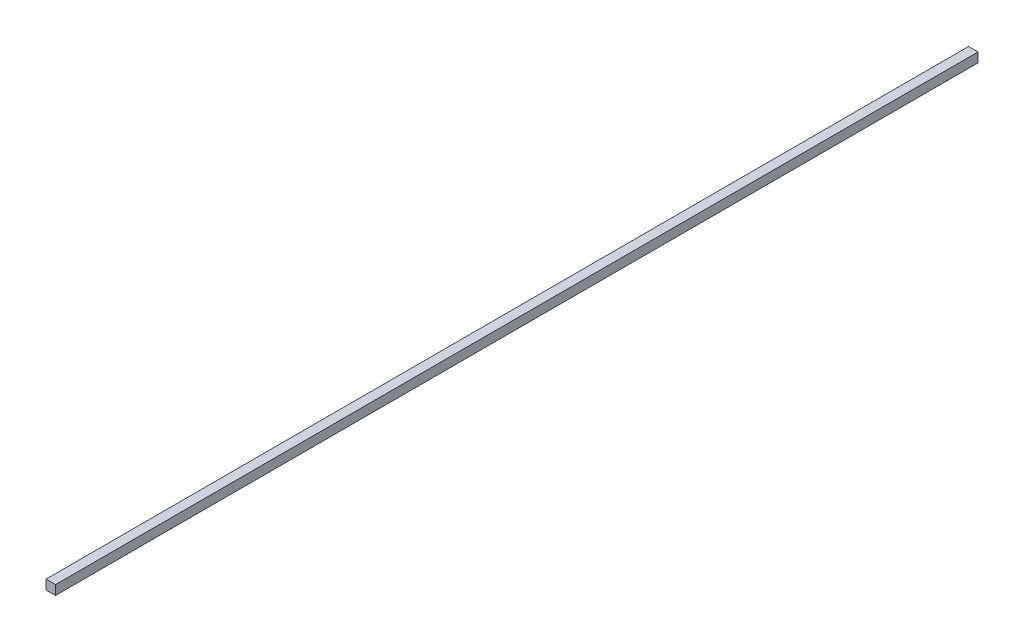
ISO-10303-21;
HEADER;
FILE_DESCRIPTION(('STEP AP214'),'2;1');
FILE_NAME('part.step','',(''),(''),'','','');
FILE_SCHEMA(('AUTOMOTIVE_DESIGN { 1 0 10303 214 1 1 1 1 }'));
ENDSEC;
DATA;
#1=APPLICATION_CONTEXT('core data for automotive mechanical design processes');
#2=APPLICATION_PROTOCOL_DEFINITION('international standard','automotive_design',2000,#1);
#3=PRODUCT_CONTEXT('',#1,'mechanical');
#4=PRODUCT('Part','Part','',(#3));
#5=PRODUCT_RELATED_PRODUCT_CATEGORY('part','',(#4));
#6=PRODUCT_DEFINITION_FORMATION('','',#4);
#7=PRODUCT_DEFINITION_CONTEXT('part definition',#1,'design');
#8=PRODUCT_DEFINITION('design','',#6,#7);
#9=PRODUCT_DEFINITION_SHAPE('','',#8);
#10=(LENGTH_UNIT() NAMED_UNIT(*) SI_UNIT(.MILLI.,.METRE.));
#11=(NAMED_UNIT(*) PLANE_ANGLE_UNIT() SI_UNIT($,.RADIAN.));
#12=(NAMED_UNIT(*) SI_UNIT($,.STERADIAN.) SOLID_ANGLE_UNIT());
#13=UNCERTAINTY_MEASURE_WITH_UNIT(LENGTH_MEASURE(1.E-05),#10,'distance_accuracy_value','');
#14=(GEOMETRIC_REPRESENTATION_CONTEXT(3) GLOBAL_UNCERTAINTY_ASSIGNED_CONTEXT((#13)) GLOBAL_UNIT_ASSIGNED_CONTEXT((#10,
#11,#12)) REPRESENTATION_CONTEXT('',''));
#15=CARTESIAN_POINT('',(0.,0.,0.));
#16=DIRECTION('',(0.,0.,1.));
#17=DIRECTION('',(1.,0.,0.));
#18=AXIS2_PLACEMENT_3D('',#15,#16,#17);
#19=CARTESIAN_POINT('',(-1.,1.,97.5));
#20=DIRECTION('',(1.,0.,0.));
#21=DIRECTION('',(0.,0.,-1.));
#22=AXIS2_PLACEMENT_3D('',#19,#20,#21);
#23=PLANE('',#22);
#24=DIRECTION('',(0.,-1.,0.));
#25=VECTOR('',#24,1.);
#26=CARTESIAN_POINT('',(-1.,1.,-97.5));
#27=LINE('',#26,#25);
#28=CARTESIAN_POINT('',(-1.,1.,-97.5));
#29=VERTEX_POINT('',#28);
#30=CARTESIAN_POINT('',(-1.,-1.,-97.5));
#31=VERTEX_POINT('',#30);
#32=EDGE_CURVE('E70',#29,#31,#27,.T.);
#33=ORIENTED_EDGE('',*,*,#32,.T.);
#34=DIRECTION('',(0.,0.,-1.));
#35=VECTOR('',#34,1.);
#36=CARTESIAN_POINT('',(-1.,-1.,97.5));
#37=LINE('',#36,#35);
#38=CARTESIAN_POINT('',(-1.,-1.,97.5));
#39=VERTEX_POINT('',#38);
#40=EDGE_CURVE('E11',#39,#31,#37,.T.);
#41=ORIENTED_EDGE('',*,*,#40,.F.);
#42=DIRECTION('',(0.,-1.,0.));
#43=VECTOR('',#42,1.);
#44=CARTESIAN_POINT('',(-1.,1.,97.5));
#45=LINE('',#44,#43);
#46=CARTESIAN_POINT('',(-1.,1.,97.5));
#47=VERTEX_POINT('',#46);
#48=EDGE_CURVE('E88',#47,#39,#45,.T.);
#49=ORIENTED_EDGE('',*,*,#48,.F.);
#50=DIRECTION('',(0.,0.,-1.));
#51=VECTOR('',#50,1.);
#52=CARTESIAN_POINT('',(-1.,1.,97.5));
#53=LINE('',#52,#51);
#54=EDGE_CURVE('E82',#47,#29,#53,.T.);
#55=ORIENTED_EDGE('',*,*,#54,.T.);
#56=EDGE_LOOP('',(#33,#41,#49,#55));
#57=FACE_BOUND('',#56,.T.);
#58=ADVANCED_FACE('F26',(#57),#23,.F.);
#59=CARTESIAN_POINT('',(-1.,-1.,97.5));
#60=DIRECTION('',(0.,1.,0.));
#61=DIRECTION('',(0.,0.,1.));
#62=AXIS2_PLACEMENT_3D('',#59,#60,#61);
#63=PLANE('',#62);
#64=DIRECTION('',(1.,0.,0.));
#65=VECTOR('',#64,1.);
#66=CARTESIAN_POINT('',(-1.,-1.,-97.5));
#67=LINE('',#66,#65);
#68=CARTESIAN_POINT('',(1.,-1.,-97.5));
#69=VERTEX_POINT('',#68);
#70=EDGE_CURVE('E66',#31,#69,#67,.T.);
#71=ORIENTED_EDGE('',*,*,#70,.T.);
#72=DIRECTION('',(0.,0.,-1.));
#73=VECTOR('',#72,1.);
#74=CARTESIAN_POINT('',(1.,-1.,97.5));
#75=LINE('',#74,#73);
#76=CARTESIAN_POINT('',(1.,-1.,97.5));
#77=VERTEX_POINT('',#76);
#78=EDGE_CURVE('E33',#77,#69,#75,.T.);
#79=ORIENTED_EDGE('',*,*,#78,.F.);
#80=DIRECTION('',(1.,0.,0.));
#81=VECTOR('',#80,1.);
#82=CARTESIAN_POINT('',(-1.,-1.,97.5));
#83=LINE('',#82,#81);
#84=EDGE_CURVE('E78',#39,#77,#83,.T.);
#85=ORIENTED_EDGE('',*,*,#84,.F.);
#86=ORIENTED_EDGE('',*,*,#40,.T.);
#87=EDGE_LOOP('',(#71,#79,#85,#86));
#88=FACE_BOUND('',#87,.T.);
#89=ADVANCED_FACE('F77',(#88),#63,.F.);
#90=CARTESIAN_POINT('',(1.,1.,97.5));
#91=DIRECTION('',(-1.,0.,0.));
#92=DIRECTION('',(0.,-1.,0.));
#93=AXIS2_PLACEMENT_3D('',#90,#91,#92);
#94=PLANE('',#93);
#95=DIRECTION('',(0.,1.,0.));
#96=VECTOR('',#95,1.);
#97=CARTESIAN_POINT('',(1.,1.,-97.5));
#98=LINE('',#97,#96);
#99=CARTESIAN_POINT('',(1.,1.,-97.5));
#100=VERTEX_POINT('',#99);
#101=EDGE_CURVE('E71',#69,#100,#98,.T.);
#102=ORIENTED_EDGE('',*,*,#101,.T.);
#103=DIRECTION('',(0.,0.,-1.));
#104=VECTOR('',#103,1.);
#105=CARTESIAN_POINT('',(1.,1.,97.5));
#106=LINE('',#105,#104);
#107=CARTESIAN_POINT('',(1.,1.,97.5));
#108=VERTEX_POINT('',#107);
#109=EDGE_CURVE('E94',#108,#100,#106,.T.);
#110=ORIENTED_EDGE('',*,*,#109,.F.);
#111=DIRECTION('',(0.,1.,0.));
#112=VECTOR('',#111,1.);
#113=CARTESIAN_POINT('',(1.,1.,97.5));
#114=LINE('',#113,#112);
#115=EDGE_CURVE('E45',#77,#108,#114,.T.);
#116=ORIENTED_EDGE('',*,*,#115,.F.);
#117=ORIENTED_EDGE('',*,*,#78,.T.);
#118=EDGE_LOOP('',(#102,#110,#116,#117));
#119=FACE_BOUND('',#118,.T.);
#120=ADVANCED_FACE('F97',(#119),#94,.F.);
#121=CARTESIAN_POINT('',(-1.,1.,97.5));
#122=DIRECTION('',(0.,-1.,0.));
#123=DIRECTION('',(1.,0.,0.));
#124=AXIS2_PLACEMENT_3D('',#121,#122,#123);
#125=PLANE('',#124);
#126=DIRECTION('',(-1.,0.,0.));
#127=VECTOR('',#126,1.);
#128=CARTESIAN_POINT('',(-1.,1.,-97.5));
#129=LINE('',#128,#127);
#130=EDGE_CURVE('E86',#100,#29,#129,.T.);
#131=ORIENTED_EDGE('',*,*,#130,.T.);
#132=ORIENTED_EDGE('',*,*,#54,.F.);
#133=DIRECTION('',(-1.,0.,0.));
#134=VECTOR('',#133,1.);
#135=CARTESIAN_POINT('',(-1.,1.,97.5));
#136=LINE('',#135,#134);
#137=EDGE_CURVE('E40',#108,#47,#136,.T.);
#138=ORIENTED_EDGE('',*,*,#137,.F.);
#139=ORIENTED_EDGE('',*,*,#109,.T.);
#140=EDGE_LOOP('',(#131,#132,#138,#139));
#141=FACE_BOUND('',#140,.T.);
#142=ADVANCED_FACE('F99',(#141),#125,.F.);
#143=CARTESIAN_POINT('',(-1.,-1.,97.5));
#144=DIRECTION('',(0.,0.,1.));
#145=DIRECTION('',(1.,0.,0.));
#146=AXIS2_PLACEMENT_3D('',#143,#144,#145);
#147=PLANE('',#146);
#148=ORIENTED_EDGE('',*,*,#48,.T.);
#149=ORIENTED_EDGE('',*,*,#84,.T.);
#150=ORIENTED_EDGE('',*,*,#115,.T.);
#151=ORIENTED_EDGE('',*,*,#137,.T.);
#152=EDGE_LOOP('',(#148,#149,#150,#151));
#153=FACE_BOUND('',#152,.T.);
#154=ADVANCED_FACE('F100',(#153),#147,.T.);
#155=CARTESIAN_POINT('',(-1.,-1.,-97.5));
#156=DIRECTION('',(0.,0.,1.));
#157=DIRECTION('',(1.,0.,0.));
#158=AXIS2_PLACEMENT_3D('',#155,#156,#157);
#159=PLANE('',#158);
#160=ORIENTED_EDGE('',*,*,#32,.F.);
#161=ORIENTED_EDGE('',*,*,#130,.F.);
#162=ORIENTED_EDGE('',*,*,#101,.F.);
#163=ORIENTED_EDGE('',*,*,#70,.F.);
#164=EDGE_LOOP('',(#160,#161,#162,#163));
#165=FACE_BOUND('',#164,.T.);
#166=ADVANCED_FACE('F67',(#165),#159,.F.);
#167=CLOSED_SHELL('',(#58,#89,#120,#142,#154,#166));
#168=MANIFOLD_SOLID_BREP('B2',#167);
#169=ADVANCED_BREP_SHAPE_REPRESENTATION('',(#18,#168),#14);
#170=SHAPE_DEFINITION_REPRESENTATION(#9,#169);
ENDSEC;
END-ISO-10303-21;
